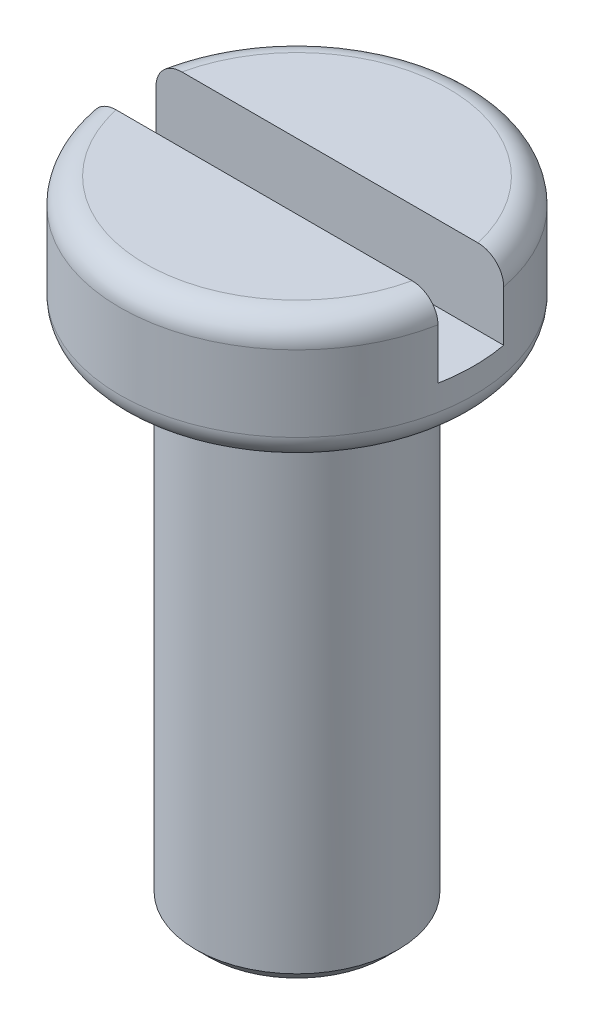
from build123d import *

# Parameters (mm, degrees)
ESQUISSE1_R             = 3.5
BOSS_EXTRU_1_DEPTH      = 2.5
ENL_V_START             = -1.5
ENL_V_MAT_EXTRU_1_DEPTH = 1.5
CONG_1_R                = 0.5
ESQUISSE3_R             = 2
BOSS_EXTRU_2_DEPTH      = 10
CHANFREIN1_SIZE         = 0.25


with BuildPart() as part:
    # Esquisse1 → Boss.-Extru.1 (new body)
    with BuildSketch(Plane(origin=(0, 0, 0), x_dir=(1, 0, 0), z_dir=(0, 1, 0))):
        with Locations(Location((0, 0, 0), (0, 0, 270))):
            Circle(ESQUISSE1_R)
    extrude(amount=BOSS_EXTRU_1_DEPTH)

    # Esquisse2 → Enl_v. mat.-Extru.1 (cut)
    with BuildSketch(Plane(origin=(0, 2.5, 0), x_dir=(1, 0, 0), z_dir=(0, 1, 0)).offset(ENL_V_START)):
        with BuildLine():
            Line((-3.439113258, 0.65), (3.439113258, 0.65))
            ThreePointArc((3.439113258, 0.65), (3.5, 0), (3.439113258, -0.65))
            Line((3.439113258, -0.65), (-3.439113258, -0.65))
            ThreePointArc((-3.439113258, -0.65), (-3.5, 0), (-3.439113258, 0.65))
        make_face()
    extrude(amount=ENL_V_MAT_EXTRU_1_DEPTH, mode=Mode.SUBTRACT)

    # Cong_1
    cong_1_edges = [part.edges().sort_by_distance(p)[0] for p in [
        (0, 0, -3.5),
        (0, 2.5, -3.5),
        (2.233271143, 2.5, 2.694902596),
    ]]
    fillet(cong_1_edges, radius=CONG_1_R)

    # Esquisse3 → Boss.-Extru.2 (add)
    with BuildSketch(Plane.XZ):
        with Locations(Location((0, 0, 0), (0, 0, 90))):
            Circle(ESQUISSE3_R)
    extrude(amount=BOSS_EXTRU_2_DEPTH)

    # Chanfrein1
    chanfrein1_edges = [part.edges().sort_by_distance(p)[0] for p in [
        (0, -10, -2),
    ]]
    chamfer(chanfrein1_edges, length=CHANFREIN1_SIZE)


solid = part.part
